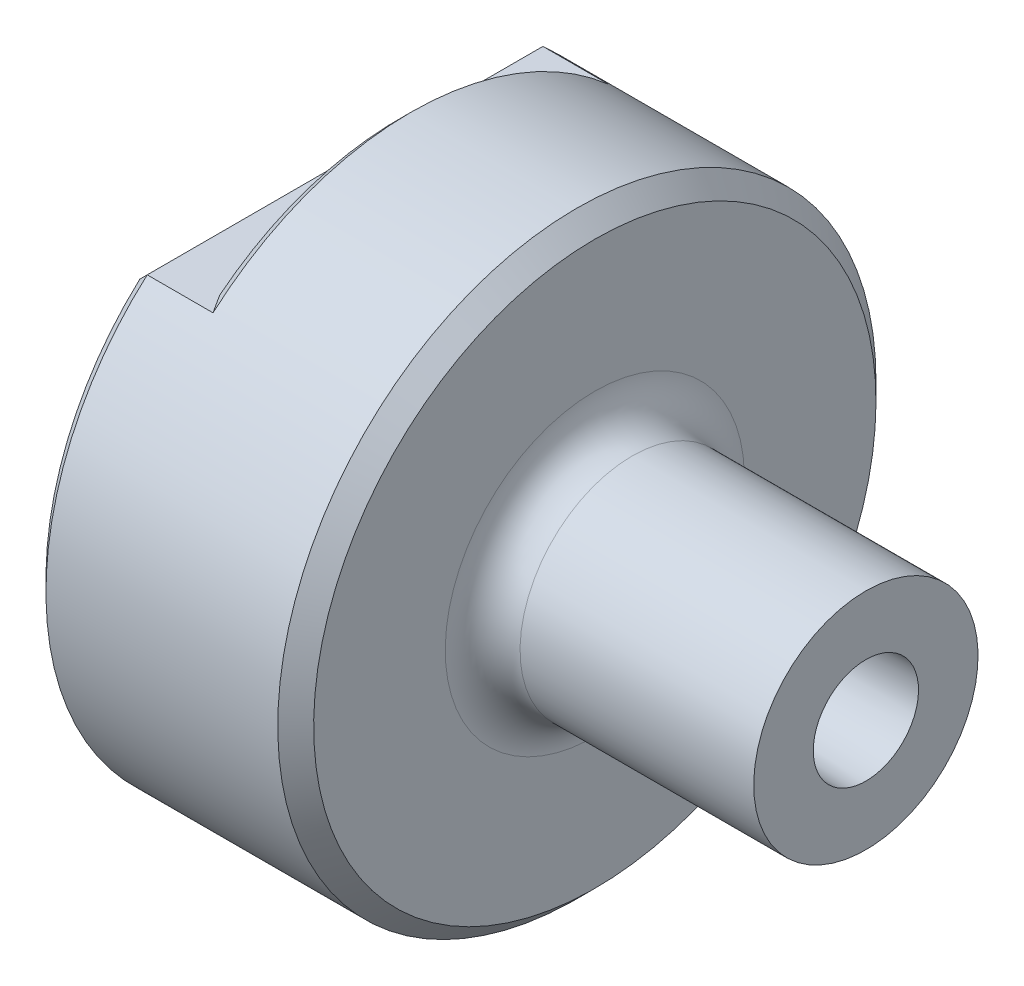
ISO-10303-21;
HEADER;
FILE_DESCRIPTION(('STEP AP214'),'2;1');
FILE_NAME('part.step','',(''),(''),'','','');
FILE_SCHEMA(('AUTOMOTIVE_DESIGN { 1 0 10303 214 1 1 1 1 }'));
ENDSEC;
DATA;
#1=APPLICATION_CONTEXT('core data for automotive mechanical design processes');
#2=APPLICATION_PROTOCOL_DEFINITION('international standard','automotive_design',2000,#1);
#3=PRODUCT_CONTEXT('',#1,'mechanical');
#4=PRODUCT('Part','Part','',(#3));
#5=PRODUCT_RELATED_PRODUCT_CATEGORY('part','',(#4));
#6=PRODUCT_DEFINITION_FORMATION('','',#4);
#7=PRODUCT_DEFINITION_CONTEXT('part definition',#1,'design');
#8=PRODUCT_DEFINITION('design','',#6,#7);
#9=PRODUCT_DEFINITION_SHAPE('','',#8);
#10=(LENGTH_UNIT() NAMED_UNIT(*) SI_UNIT(.MILLI.,.METRE.));
#11=(NAMED_UNIT(*) PLANE_ANGLE_UNIT() SI_UNIT($,.RADIAN.));
#12=(NAMED_UNIT(*) SI_UNIT($,.STERADIAN.) SOLID_ANGLE_UNIT());
#13=UNCERTAINTY_MEASURE_WITH_UNIT(LENGTH_MEASURE(1.E-05),#10,'distance_accuracy_value','');
#14=(GEOMETRIC_REPRESENTATION_CONTEXT(3) GLOBAL_UNCERTAINTY_ASSIGNED_CONTEXT((#13)) GLOBAL_UNIT_ASSIGNED_CONTEXT((#10,
#11,#12)) REPRESENTATION_CONTEXT('',''));
#15=CARTESIAN_POINT('',(0.,0.,0.));
#16=DIRECTION('',(0.,0.,1.));
#17=DIRECTION('',(1.,0.,0.));
#18=AXIS2_PLACEMENT_3D('',#15,#16,#17);
#19=CARTESIAN_POINT('',(22.621875,0.,0.));
#20=DIRECTION('',(1.,0.,0.));
#21=DIRECTION('',(0.,0.,-1.));
#22=AXIS2_PLACEMENT_3D('',#19,#20,#21);
#23=PLANE('',#22);
#24=CARTESIAN_POINT('',(22.621875,0.,0.));
#25=DIRECTION('',(1.,0.,0.));
#26=DIRECTION('',(0.,1.,0.));
#27=AXIS2_PLACEMENT_3D('',#24,#25,#26);
#28=CIRCLE('',#27,9.525);
#29=CARTESIAN_POINT('',(22.621875,9.525,0.));
#30=VERTEX_POINT('',#29);
#31=EDGE_CURVE('E101',#30,#30,#28,.T.);
#32=ORIENTED_EDGE('',*,*,#31,.T.);
#33=EDGE_LOOP('',(#32));
#34=FACE_BOUND('',#33,.T.);
#35=CARTESIAN_POINT('',(22.621875,0.,0.));
#36=DIRECTION('',(1.,0.,0.));
#37=DIRECTION('',(0.,1.,0.));
#38=AXIS2_PLACEMENT_3D('',#35,#36,#37);
#39=CIRCLE('',#38,4.46941315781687);
#40=CARTESIAN_POINT('',(22.621875,4.46941315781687,0.));
#41=VERTEX_POINT('',#40);
#42=EDGE_CURVE('E157',#41,#41,#39,.T.);
#43=ORIENTED_EDGE('',*,*,#42,.F.);
#44=EDGE_LOOP('',(#43));
#45=FACE_BOUND('',#44,.T.);
#46=ADVANCED_FACE('F32',(#34,#45),#23,.T.);
#47=CARTESIAN_POINT('',(-22.621875,0.,0.));
#48=DIRECTION('',(1.,0.,0.));
#49=DIRECTION('',(0.,0.,-1.));
#50=AXIS2_PLACEMENT_3D('',#47,#48,#49);
#51=PLANE('',#50);
#52=CARTESIAN_POINT('',(-22.621875,0.,0.));
#53=DIRECTION('',(1.,0.,0.));
#54=DIRECTION('',(0.,0.,-1.));
#55=AXIS2_PLACEMENT_3D('',#52,#53,#54);
#56=CIRCLE('',#55,24.384);
#57=CARTESIAN_POINT('',(-22.621875,18.034,-16.4120169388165));
#58=VERTEX_POINT('',#57);
#59=CARTESIAN_POINT('',(-22.621875,18.034,16.4120169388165));
#60=VERTEX_POINT('',#59);
#61=EDGE_CURVE('E52',#58,#60,#56,.F.);
#62=ORIENTED_EDGE('',*,*,#61,.T.);
#63=DIRECTION('',(0.,0.,-1.));
#64=VECTOR('',#63,1.);
#65=CARTESIAN_POINT('',(-22.621875,18.034,0.));
#66=LINE('',#65,#64);
#67=EDGE_CURVE('E126',#60,#58,#66,.T.);
#68=ORIENTED_EDGE('',*,*,#67,.T.);
#69=EDGE_LOOP('',(#62,#68));
#70=FACE_BOUND('',#69,.T.);
#71=CARTESIAN_POINT('',(-22.621875,0.,0.));
#72=DIRECTION('',(1.,0.,0.));
#73=DIRECTION('',(0.,1.,0.));
#74=AXIS2_PLACEMENT_3D('',#71,#72,#73);
#75=CIRCLE('',#74,9.80045101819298);
#76=CARTESIAN_POINT('',(-22.621875,9.80045101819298,0.));
#77=VERTEX_POINT('',#76);
#78=EDGE_CURVE('E106',#77,#77,#75,.T.);
#79=ORIENTED_EDGE('',*,*,#78,.T.);
#80=EDGE_LOOP('',(#79));
#81=FACE_BOUND('',#80,.T.);
#82=ADVANCED_FACE('F166',(#70,#81),#51,.F.);
#83=CARTESIAN_POINT('',(22.621875,0.,0.));
#84=DIRECTION('',(-1.,0.,0.));
#85=DIRECTION('',(0.,0.,1.));
#86=AXIS2_PLACEMENT_3D('',#83,#84,#85);
#87=CYLINDRICAL_SURFACE('',#86,25.4);
#88=CARTESIAN_POINT('',(-1.92087500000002,0.,0.));
#89=DIRECTION('',(1.,0.,0.));
#90=DIRECTION('',(0.,0.,-1.));
#91=AXIS2_PLACEMENT_3D('',#88,#89,#90);
#92=CIRCLE('',#91,25.4);
#93=CARTESIAN_POINT('',(-1.92087500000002,0.,-25.4));
#94=VERTEX_POINT('',#93);
#95=EDGE_CURVE('E97',#94,#94,#92,.F.);
#96=ORIENTED_EDGE('',*,*,#95,.T.);
#97=EDGE_LOOP('',(#96));
#98=FACE_BOUND('',#97,.T.);
#99=DIRECTION('',(-1.,0.,0.));
#100=VECTOR('',#99,1.);
#101=CARTESIAN_POINT('',(22.621875,19.05,-16.8005208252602));
#102=LINE('',#101,#100);
#103=CARTESIAN_POINT('',(-21.605875,19.05,-16.8005208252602));
#104=VERTEX_POINT('',#103);
#105=CARTESIAN_POINT('',(-16.017875,19.05,-16.8005208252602));
#106=VERTEX_POINT('',#105);
#107=EDGE_CURVE('E100',#104,#106,#102,.F.);
#108=ORIENTED_EDGE('',*,*,#107,.T.);
#109=CARTESIAN_POINT('',(-16.017875,0.,0.));
#110=DIRECTION('',(-1.,0.,0.));
#111=DIRECTION('',(0.,0.,1.));
#112=AXIS2_PLACEMENT_3D('',#109,#110,#111);
#113=CIRCLE('',#112,25.4);
#114=CARTESIAN_POINT('',(-16.017875,19.05,16.8005208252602));
#115=VERTEX_POINT('',#114);
#116=EDGE_CURVE('E86',#106,#115,#113,.F.);
#117=ORIENTED_EDGE('',*,*,#116,.T.);
#118=DIRECTION('',(-1.,0.,0.));
#119=VECTOR('',#118,1.);
#120=CARTESIAN_POINT('',(22.621875,19.05,16.8005208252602));
#121=LINE('',#120,#119);
#122=CARTESIAN_POINT('',(-21.605875,19.05,16.8005208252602));
#123=VERTEX_POINT('',#122);
#124=EDGE_CURVE('E103',#115,#123,#121,.T.);
#125=ORIENTED_EDGE('',*,*,#124,.T.);
#126=CARTESIAN_POINT('',(-21.605875,0.,0.));
#127=DIRECTION('',(1.,0.,0.));
#128=DIRECTION('',(0.,0.,-1.));
#129=AXIS2_PLACEMENT_3D('',#126,#127,#128);
#130=CIRCLE('',#129,25.4);
#131=EDGE_CURVE('E96',#123,#104,#130,.T.);
#132=ORIENTED_EDGE('',*,*,#131,.T.);
#133=EDGE_LOOP('',(#108,#117,#125,#132));
#134=FACE_BOUND('',#133,.T.);
#135=ADVANCED_FACE('F188',(#98,#134),#87,.T.);
#136=CARTESIAN_POINT('',(-17.033875,0.,0.));
#137=DIRECTION('',(-1.,0.,0.));
#138=DIRECTION('',(0.,0.,1.));
#139=AXIS2_PLACEMENT_3D('',#136,#137,#138);
#140=PLANE('',#139);
#141=DIRECTION('',(0.,0.,1.));
#142=VECTOR('',#141,1.);
#143=CARTESIAN_POINT('',(-17.033875,19.05,-25.4));
#144=LINE('',#143,#142);
#145=CARTESIAN_POINT('',(-17.033875,19.05,-15.2209380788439));
#146=VERTEX_POINT('',#145);
#147=CARTESIAN_POINT('',(-17.033875,19.05,15.2209380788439));
#148=VERTEX_POINT('',#147);
#149=EDGE_CURVE('E95',#146,#148,#144,.T.);
#150=ORIENTED_EDGE('',*,*,#149,.T.);
#151=CARTESIAN_POINT('',(-17.033875,0.,0.));
#152=DIRECTION('',(-1.,0.,0.));
#153=DIRECTION('',(0.,0.,1.));
#154=AXIS2_PLACEMENT_3D('',#151,#152,#153);
#155=CIRCLE('',#154,24.384);
#156=EDGE_CURVE('E84',#148,#146,#155,.T.);
#157=ORIENTED_EDGE('',*,*,#156,.T.);
#158=EDGE_LOOP('',(#150,#157));
#159=FACE_BOUND('',#158,.T.);
#160=ADVANCED_FACE('F94',(#159),#140,.T.);
#161=CARTESIAN_POINT('',(-17.033875,19.05,-25.4));
#162=DIRECTION('',(0.,-1.,0.));
#163=DIRECTION('',(0.,0.,-1.));
#164=AXIS2_PLACEMENT_3D('',#161,#162,#163);
#165=PLANE('',#164);
#166=ORIENTED_EDGE('',*,*,#107,.F.);
#167=DIRECTION('',(0.,0.,1.));
#168=VECTOR('',#167,1.);
#169=CARTESIAN_POINT('',(-21.605875,19.05,-25.4));
#170=LINE('',#169,#168);
#171=EDGE_CURVE('E90',#104,#123,#170,.T.);
#172=ORIENTED_EDGE('',*,*,#171,.T.);
#173=ORIENTED_EDGE('',*,*,#124,.F.);
#174=CARTESIAN_POINT('',(-16.017875,19.05,16.8005208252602));
#175=CARTESIAN_POINT('',(-16.1042219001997,19.05,16.6699759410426));
#176=CARTESIAN_POINT('',(-16.190175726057,19.05,16.5391707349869));
#177=CARTESIAN_POINT('',(-16.3612541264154,19.05,16.2770272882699));
#178=CARTESIAN_POINT('',(-16.4463787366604,19.05,16.1456890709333));
#179=CARTESIAN_POINT('',(-16.6157633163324,19.05,15.8824555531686));
#180=CARTESIAN_POINT('',(-16.7000232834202,19.05,15.7505602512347));
#181=CARTESIAN_POINT('',(-16.8676390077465,19.05,15.4861884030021));
#182=CARTESIAN_POINT('',(-16.9509947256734,19.05,15.3537118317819));
#183=CARTESIAN_POINT('',(-17.033875,19.05,15.2209380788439));
#184=B_SPLINE_CURVE_WITH_KNOTS('',3,(#174,#175,#176,#177,#178,#179,#180,#181,#182,#183),
.UNSPECIFIED.,.F.,.F.,(4,2,2,2,4),(0.,0.469552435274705,0.939084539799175,1.40861791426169,
1.87817162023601),.UNSPECIFIED.);
#185=EDGE_CURVE('E11',#115,#148,#184,.T.);
#186=ORIENTED_EDGE('',*,*,#185,.T.);
#187=ORIENTED_EDGE('',*,*,#149,.F.);
#188=CARTESIAN_POINT('',(-17.033875,19.05,-15.2209380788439));
#189=CARTESIAN_POINT('',(-16.9509947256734,19.05,-15.3537118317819));
#190=CARTESIAN_POINT('',(-16.8676390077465,19.05,-15.4861884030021));
#191=CARTESIAN_POINT('',(-16.7000232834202,19.05,-15.7505602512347));
#192=CARTESIAN_POINT('',(-16.6157633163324,19.05,-15.8824555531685));
#193=CARTESIAN_POINT('',(-16.4463787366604,19.05,-16.1456890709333));
#194=CARTESIAN_POINT('',(-16.3612541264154,19.05,-16.2770272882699));
#195=CARTESIAN_POINT('',(-16.190175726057,19.05,-16.5391707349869));
#196=CARTESIAN_POINT('',(-16.1042219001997,19.05,-16.6699759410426));
#197=CARTESIAN_POINT('',(-16.017875,19.05,-16.8005208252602));
#198=B_SPLINE_CURVE_WITH_KNOTS('',3,(#188,#189,#190,#191,#192,#193,#194,#195,#196,#197),
.UNSPECIFIED.,.F.,.F.,(4,2,2,2,4),(0.,0.469553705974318,0.939087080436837,1.40861918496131,
1.87817162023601),.UNSPECIFIED.);
#199=EDGE_CURVE('E45',#146,#106,#198,.T.);
#200=ORIENTED_EDGE('',*,*,#199,.T.);
#201=EDGE_LOOP('',(#166,#172,#173,#186,#187,#200));
#202=FACE_BOUND('',#201,.T.);
#203=ADVANCED_FACE('F99',(#202),#165,.F.);
#204=CARTESIAN_POINT('',(-0.396875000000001,-25.4,0.));
#205=DIRECTION('',(1.,0.,0.));
#206=DIRECTION('',(0.,1.,0.));
#207=AXIS2_PLACEMENT_3D('',#204,#205,#206);
#208=PLANE('',#207);
#209=CARTESIAN_POINT('',(-0.396875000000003,0.,0.));
#210=DIRECTION('',(1.,0.,0.));
#211=DIRECTION('',(0.,1.,0.));
#212=AXIS2_PLACEMENT_3D('',#209,#210,#211);
#213=CIRCLE('',#212,23.876);
#214=CARTESIAN_POINT('',(-0.396875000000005,23.876,0.));
#215=VERTEX_POINT('',#214);
#216=EDGE_CURVE('E118',#215,#215,#213,.T.);
#217=ORIENTED_EDGE('',*,*,#216,.T.);
#218=EDGE_LOOP('',(#217));
#219=FACE_BOUND('',#218,.T.);
#220=CARTESIAN_POINT('',(-0.396875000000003,0.,0.));
#221=DIRECTION('',(1.,0.,0.));
#222=DIRECTION('',(0.,1.,0.));
#223=AXIS2_PLACEMENT_3D('',#220,#221,#222);
#224=CIRCLE('',#223,12.7);
#225=CARTESIAN_POINT('',(-0.396875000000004,12.7,0.));
#226=VERTEX_POINT('',#225);
#227=EDGE_CURVE('E115',#226,#226,#224,.F.);
#228=ORIENTED_EDGE('',*,*,#227,.T.);
#229=EDGE_LOOP('',(#228));
#230=FACE_BOUND('',#229,.T.);
#231=ADVANCED_FACE('F180',(#219,#230),#208,.T.);
#232=CARTESIAN_POINT('',(22.621875,0.,0.));
#233=DIRECTION('',(1.,0.,0.));
#234=DIRECTION('',(0.,1.,0.));
#235=AXIS2_PLACEMENT_3D('',#232,#233,#234);
#236=CYLINDRICAL_SURFACE('',#235,9.525);
#237=CARTESIAN_POINT('',(2.778125,0.,0.));
#238=DIRECTION('',(1.,0.,0.));
#239=DIRECTION('',(0.,1.,0.));
#240=AXIS2_PLACEMENT_3D('',#237,#238,#239);
#241=CIRCLE('',#240,9.525);
#242=CARTESIAN_POINT('',(2.77812499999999,9.525,0.));
#243=VERTEX_POINT('',#242);
#244=EDGE_CURVE('E112',#243,#243,#241,.T.);
#245=ORIENTED_EDGE('',*,*,#244,.T.);
#246=EDGE_LOOP('',(#245));
#247=FACE_BOUND('',#246,.T.);
#248=ORIENTED_EDGE('',*,*,#31,.F.);
#249=EDGE_LOOP('',(#248));
#250=FACE_BOUND('',#249,.T.);
#251=ADVANCED_FACE('F171',(#247,#250),#236,.T.);
#252=CARTESIAN_POINT('',(-30.699075,0.,0.));
#253=DIRECTION('',(1.,0.,0.));
#254=DIRECTION('',(0.,1.,0.));
#255=AXIS2_PLACEMENT_3D('',#252,#253,#254);
#256=SPHERICAL_SURFACE('',#255,12.7);
#257=CARTESIAN_POINT('',(-18.5117164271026,0.,0.));
#258=DIRECTION('',(1.,0.,0.));
#259=DIRECTION('',(0.,1.,0.));
#260=AXIS2_PLACEMENT_3D('',#257,#258,#259);
#261=CIRCLE('',#260,3.571875);
#262=CARTESIAN_POINT('',(-18.5117164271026,3.57187500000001,0.));
#263=VERTEX_POINT('',#262);
#264=EDGE_CURVE('E154',#263,#263,#261,.T.);
#265=CARTESIAN_POINT('',(-18.5117164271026,3.57187500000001,0.));
#266=CARTESIAN_POINT('',(-18.5339064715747,3.64758850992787,0.));
#267=CARTESIAN_POINT('',(-18.5568022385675,3.72309518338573,0.));
#268=CARTESIAN_POINT('',(-18.6039968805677,3.87366875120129,0.));
#269=CARTESIAN_POINT('',(-18.628295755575,3.94873564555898,0.));
#270=CARTESIAN_POINT('',(-18.6782882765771,4.09840354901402,0.));
#271=CARTESIAN_POINT('',(-18.7039819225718,4.17300455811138,0.));
#272=CARTESIAN_POINT('',(-18.756755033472,4.32171478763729,0.));
#273=CARTESIAN_POINT('',(-18.7838344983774,4.39582400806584,0.));
#274=CARTESIAN_POINT('',(-18.8393698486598,4.54352491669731,0.));
#275=CARTESIAN_POINT('',(-18.8678257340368,4.61711660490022,0.));
#276=CARTESIAN_POINT('',(-18.9261040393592,4.76375688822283,0.));
#277=CARTESIAN_POINT('',(-18.9559264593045,4.83680548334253,0.));
#278=CARTESIAN_POINT('',(-19.0169274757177,4.98233420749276,0.));
#279=CARTESIAN_POINT('',(-19.0481060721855,5.05481433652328,0.));
#280=CARTESIAN_POINT('',(-19.1118086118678,5.19918095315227,0.));
#281=CARTESIAN_POINT('',(-19.1443325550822,5.27106744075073,0.));
#282=CARTESIAN_POINT('',(-19.2107144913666,5.41422180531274,0.));
#283=CARTESIAN_POINT('',(-19.2445724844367,5.48548968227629,0.));
#284=CARTESIAN_POINT('',(-19.3136107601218,5.62738207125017,0.));
#285=CARTESIAN_POINT('',(-19.3487910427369,5.6980065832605,0.));
#286=CARTESIAN_POINT('',(-19.4204616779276,5.83858771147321,0.));
#287=CARTESIAN_POINT('',(-19.4569520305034,5.90854432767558,0.));
#288=CARTESIAN_POINT('',(-19.5312301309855,6.04776536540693,0.));
#289=CARTESIAN_POINT('',(-19.569017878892,6.11702978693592,0.));
#290=CARTESIAN_POINT('',(-19.6458776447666,6.25484237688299,0.));
#291=CARTESIAN_POINT('',(-19.6849496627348,6.32339054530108,0.));
#292=CARTESIAN_POINT('',(-19.7643643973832,6.45974681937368,0.));
#293=CARTESIAN_POINT('',(-19.8047071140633,6.52755492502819,0.));
#294=CARTESIAN_POINT('',(-19.8866492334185,6.66240752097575,0.));
#295=CARTESIAN_POINT('',(-19.9282486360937,6.7294520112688,0.));
#296=CARTESIAN_POINT('',(-20.0126896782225,6.8627540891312,0.));
#297=CARTESIAN_POINT('',(-20.0555313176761,6.92901167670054,0.));
#298=CARTESIAN_POINT('',(-20.1424419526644,7.06071693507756,0.));
#299=CARTESIAN_POINT('',(-20.186510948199,7.12616460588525,0.));
#300=CARTESIAN_POINT('',(-20.2758609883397,7.25622729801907,0.));
#301=CARTESIAN_POINT('',(-20.3211420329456,7.3208423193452,0.));
#302=CARTESIAN_POINT('',(-20.4129004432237,7.44921726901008,0.));
#303=CARTESIAN_POINT('',(-20.4593778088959,7.51297719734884,0.));
#304=CARTESIAN_POINT('',(-20.5535127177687,7.63961981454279,0.));
#305=CARTESIAN_POINT('',(-20.6011702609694,7.70250250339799,0.));
#306=CARTESIAN_POINT('',(-20.6976489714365,7.82736879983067,0.));
#307=CARTESIAN_POINT('',(-20.7464701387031,7.88935240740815,0.));
#308=CARTESIAN_POINT('',(-20.8452591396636,8.01239901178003,0.));
#309=CARTESIAN_POINT('',(-20.8952269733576,8.07346200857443,0.));
#310=CARTESIAN_POINT('',(-20.9962919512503,8.19464618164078,0.));
#311=CARTESIAN_POINT('',(-21.0473890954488,8.25476735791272,0.));
#312=CARTESIAN_POINT('',(-21.1506949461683,8.3740470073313,0.));
#313=CARTESIAN_POINT('',(-21.2029036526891,8.43320548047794,0.));
#314=CARTESIAN_POINT('',(-21.3084144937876,8.55053917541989,0.));
#315=CARTESIAN_POINT('',(-21.3617166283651,8.6087143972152,0.));
#316=CARTESIAN_POINT('',(-21.469395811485,8.72406138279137,0.));
#317=CARTESIAN_POINT('',(-21.5237728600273,8.78123314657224,0.));
#318=CARTESIAN_POINT('',(-21.6335829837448,8.89455335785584,0.));
#319=CARTESIAN_POINT('',(-21.6890160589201,8.95070180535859,0.));
#320=CARTESIAN_POINT('',(-21.800918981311,9.06195588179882,0.));
#321=CARTESIAN_POINT('',(-21.8573888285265,9.11706151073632,0.));
#322=CARTESIAN_POINT('',(-21.9713456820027,9.22621080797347,0.));
#323=CARTESIAN_POINT('',(-22.0288326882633,9.28025447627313,0.));
#324=CARTESIAN_POINT('',(-22.1448038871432,9.3872610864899,0.));
#325=CARTESIAN_POINT('',(-22.2032880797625,9.44022402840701,0.));
#326=CARTESIAN_POINT('',(-22.3212333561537,9.54505076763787,0.));
#327=CARTESIAN_POINT('',(-22.3806944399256,9.59691456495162,0.));
#328=CARTESIAN_POINT('',(-22.5005727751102,9.69952508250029,0.));
#329=CARTESIAN_POINT('',(-22.5609900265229,9.75027180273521,0.));
#330=CARTESIAN_POINT('',(-22.621875,9.80045101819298,0.));
#331=B_SPLINE_CURVE_WITH_KNOTS('',3,(#265,#266,#267,#268,#269,#270,#271,#272,#273,#274,#275,
#276,#277,#278,#279,#280,#281,#282,#283,#284,#285,#286,#287,#288,#289,#290,#291,#292,#293,#294,
#295,#296,#297,#298,#299,#300,#301,#302,#303,#304,#305,#306,#307,#308,#309,#310,#311,#312,#313,
#314,#315,#316,#317,#318,#319,#320,#321,#322,#323,#324,#325,#326,#327,#328,#329,#330),
.UNSPECIFIED.,.F.,.F.,(4,2,2,2,2,2,2,2,2,2,2,2,2,2,2,2,2,2,2,2,2,2,2,2,2,2,2,2,2,2,2,2,4),(0.,
0.236691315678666,0.473382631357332,0.710073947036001,0.946765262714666,1.18345657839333,
1.420147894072,1.65683920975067,1.89353052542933,2.130221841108,2.36691315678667,
2.60360447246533,2.840295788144,3.07698710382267,3.31367841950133,3.55036973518,
3.78706105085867,4.02375236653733,4.260443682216,4.49713499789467,4.73382631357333,
4.970517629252,5.20720894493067,5.44390026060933,5.680591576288,5.91728289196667,
6.15397420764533,6.390665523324,6.62735683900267,6.86404815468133,7.10073947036,
7.33743078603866,7.57412210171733),.UNSPECIFIED.);
#332=EDGE_CURVE('BSEAM168',#263,#77,#331,.T.);
#333=ORIENTED_EDGE('',*,*,#264,.T.);
#334=ORIENTED_EDGE('',*,*,#78,.F.);
#335=ORIENTED_EDGE('',*,*,#332,.T.);
#336=ORIENTED_EDGE('',*,*,#332,.F.);
#337=EDGE_LOOP('',(#333,#335,#334,#336));
#338=FACE_BOUND('',#337,.T.);
#339=ADVANCED_FACE('F168',(#338),#256,.F.);
#340=CARTESIAN_POINT('',(-18.5117164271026,0.,0.));
#341=DIRECTION('',(1.,0.,0.));
#342=DIRECTION('',(0.,1.,0.));
#343=AXIS2_PLACEMENT_3D('',#340,#341,#342);
#344=CONICAL_SURFACE('',#343,3.571875,0.0218166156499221);
#345=ORIENTED_EDGE('',*,*,#42,.T.);
#346=EDGE_LOOP('',(#345));
#347=FACE_BOUND('',#346,.T.);
#348=ORIENTED_EDGE('',*,*,#264,.F.);
#349=EDGE_LOOP('',(#348));
#350=FACE_BOUND('',#349,.T.);
#351=ADVANCED_FACE('F170',(#347,#350),#344,.F.);
#352=CARTESIAN_POINT('',(2.778125,0.,0.));
#353=DIRECTION('',(1.,0.,0.));
#354=DIRECTION('',(0.,1.,0.));
#355=AXIS2_PLACEMENT_3D('',#352,#353,#354);
#356=TOROIDAL_SURFACE('',#355,12.7,3.175);
#357=ORIENTED_EDGE('',*,*,#227,.F.);
#358=EDGE_LOOP('',(#357));
#359=FACE_BOUND('',#358,.T.);
#360=ORIENTED_EDGE('',*,*,#244,.F.);
#361=EDGE_LOOP('',(#360));
#362=FACE_BOUND('',#361,.T.);
#363=ADVANCED_FACE('F177',(#359,#362),#356,.F.);
#364=CARTESIAN_POINT('',(-0.396875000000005,0.,0.));
#365=DIRECTION('',(-1.,0.,0.));
#366=DIRECTION('',(0.,0.,1.));
#367=AXIS2_PLACEMENT_3D('',#364,#365,#366);
#368=CONICAL_SURFACE('',#367,23.876,0.785398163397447);
#369=ORIENTED_EDGE('',*,*,#95,.F.);
#370=EDGE_LOOP('',(#369));
#371=FACE_BOUND('',#370,.T.);
#372=ORIENTED_EDGE('',*,*,#216,.F.);
#373=EDGE_LOOP('',(#372));
#374=FACE_BOUND('',#373,.T.);
#375=ADVANCED_FACE('F144',(#371,#374),#368,.T.);
#376=CARTESIAN_POINT('',(-17.033875,0.,0.));
#377=DIRECTION('',(1.,0.,0.));
#378=DIRECTION('',(0.,0.,-1.));
#379=AXIS2_PLACEMENT_3D('',#376,#377,#378);
#380=CONICAL_SURFACE('',#379,24.384,0.785398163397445);
#381=ORIENTED_EDGE('',*,*,#185,.F.);
#382=ORIENTED_EDGE('',*,*,#116,.F.);
#383=ORIENTED_EDGE('',*,*,#199,.F.);
#384=ORIENTED_EDGE('',*,*,#156,.F.);
#385=EDGE_LOOP('',(#381,#382,#383,#384));
#386=FACE_BOUND('',#385,.T.);
#387=ADVANCED_FACE('F83',(#386),#380,.T.);
#388=CARTESIAN_POINT('',(-21.605875,0.,0.));
#389=DIRECTION('',(1.,0.,0.));
#390=DIRECTION('',(0.,0.,-1.));
#391=AXIS2_PLACEMENT_3D('',#388,#389,#390);
#392=CONICAL_SURFACE('',#391,25.4,0.785398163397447);
#393=CARTESIAN_POINT('',(-22.621875,18.034,-16.4120169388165));
#394=CARTESIAN_POINT('',(-22.452676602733,18.203198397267,-16.4774733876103));
#395=CARTESIAN_POINT('',(-22.2834107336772,18.3724642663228,-16.5425769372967));
#396=CARTESIAN_POINT('',(-21.9447440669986,18.7111309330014,-16.6720782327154));
#397=CARTESIAN_POINT('',(-21.7753432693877,18.8805317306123,-16.7364759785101));
#398=CARTESIAN_POINT('',(-21.605875,19.05,-16.8005208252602));
#399=B_SPLINE_CURVE_WITH_KNOTS('',3,(#393,#394,#395,#396,#397,#398),.UNSPECIFIED.,.F.,.F.,(4,2,
4),(0.,0.744219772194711,1.4884394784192),.UNSPECIFIED.);
#400=EDGE_CURVE('E60',#104,#58,#399,.F.);
#401=ORIENTED_EDGE('',*,*,#400,.F.);
#402=ORIENTED_EDGE('',*,*,#131,.F.);
#403=CARTESIAN_POINT('',(-21.605875,19.05,16.8005208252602));
#404=CARTESIAN_POINT('',(-21.7753432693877,18.8805317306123,16.7364759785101));
#405=CARTESIAN_POINT('',(-21.9447440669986,18.7111309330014,16.6720782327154));
#406=CARTESIAN_POINT('',(-22.2834107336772,18.3724642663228,16.5425769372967));
#407=CARTESIAN_POINT('',(-22.452676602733,18.203198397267,16.4774733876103));
#408=CARTESIAN_POINT('',(-22.621875,18.034,16.4120169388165));
#409=B_SPLINE_CURVE_WITH_KNOTS('',3,(#403,#404,#405,#406,#407,#408),.UNSPECIFIED.,.F.,.F.,(4,2,
4),(0.,0.744219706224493,1.4884394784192),.UNSPECIFIED.);
#410=EDGE_CURVE('E37',#60,#123,#409,.F.);
#411=ORIENTED_EDGE('',*,*,#410,.F.);
#412=ORIENTED_EDGE('',*,*,#61,.F.);
#413=EDGE_LOOP('',(#401,#402,#411,#412));
#414=FACE_BOUND('',#413,.T.);
#415=ADVANCED_FACE('F143',(#414),#392,.T.);
#416=CARTESIAN_POINT('',(-22.621875,18.034,0.));
#417=DIRECTION('',(0.707106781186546,-0.707106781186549,0.));
#418=DIRECTION('',(0.,0.,-1.));
#419=AXIS2_PLACEMENT_3D('',#416,#417,#418);
#420=PLANE('',#419);
#421=ORIENTED_EDGE('',*,*,#410,.T.);
#422=ORIENTED_EDGE('',*,*,#171,.F.);
#423=ORIENTED_EDGE('',*,*,#400,.T.);
#424=ORIENTED_EDGE('',*,*,#67,.F.);
#425=EDGE_LOOP('',(#421,#422,#423,#424));
#426=FACE_BOUND('',#425,.T.);
#427=ADVANCED_FACE('F34',(#426),#420,.F.);
#428=CLOSED_SHELL('',(#46,#82,#135,#160,#203,#231,#251,#339,#351,#363,#375,#387,#415,#427));
#429=MANIFOLD_SOLID_BREP('B2',#428);
#430=ADVANCED_BREP_SHAPE_REPRESENTATION('',(#18,#429),#14);
#431=SHAPE_DEFINITION_REPRESENTATION(#9,#430);
ENDSEC;
END-ISO-10303-21;
